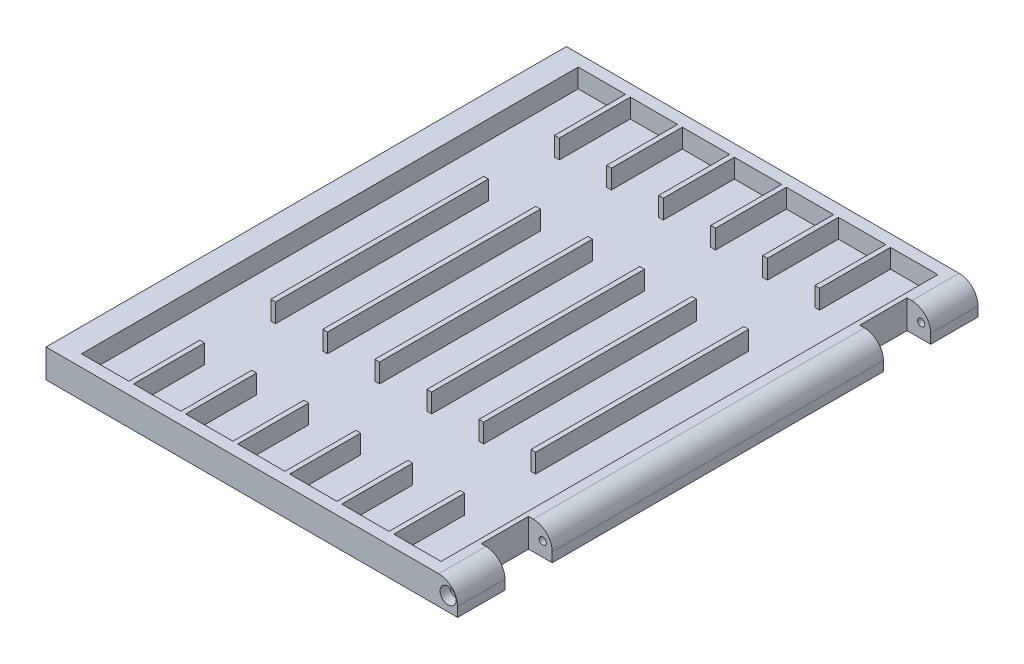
from build123d import *

# Parameters (mm, degrees)
EXTRUDE_3_DEPTH      = 4
EXTRUDE_3_DEPTH_BACK = 6
SKETCH_1_W           = 81.000407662
SKETCH_1_H           = 110
SKETCH_1_W_2         = 10
SKETCH_1_H_2         = 104.996759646
SKETCH_1_W_3         = 9.999997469
EXTRUDE_START        = -6
SKETCH_5_W           = 81.000407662
SKETCH_5_H           = 110
EXTRUDE_4_DEPTH      = 2
SKETCH_6_W           = 56.002129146
SKETCH_6_H           = 14.999755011
SKETCH_6_H_2         = 15.001340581
CUT_EXTRUDE_3_DEPTH  = 4
SKETCH_7_W           = 81.000407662
SKETCH_7_H           = 110
CUT_EXTRUDE_4_DEPTH  = 4
SKETCH_8_W           = 110
SKETCH_8_H           = 6
EXTRUDE_5_DEPTH      = 3.5
SKETCH_9_W           = 10
SKETCH_9_H           = 6
CUT_EXTRUDE_5_DEPTH  = 5
SKETCH_10_R          = 0.75
CUT_EXTRUDE_6_DEPTH  = 115
SKETCH_11_R          = 1.7
CUT_EXTRUDE_7_DEPTH  = 2
CUT_EXTRUDE_START    = -2
SKETCH_12_R          = 1.7
CUT_EXTRUDE_8_DEPTH  = 2
SKETCH_13_W          = 110
SKETCH_13_H          = 6
EXTRUDE_7_DEPTH      = 2.5
SKETCH_15_W          = 30
SKETCH_15_H          = 3.001159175
CUT_EXTRUDE_10_DEPTH = 2.5
FILLET_1_R           = 4


with BuildPart() as part:
    # Sketch 1 → Extrude 3 (new, two sides: drawn at the far end of the back side and taken through both)
    with BuildSketch(Plane(origin=(0, 0, 0), x_dir=(1, 0, 0), z_dir=(0, 1, 0)).offset(-EXTRUDE_3_DEPTH_BACK)):
        with Locations((40.500203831, 55)):
            Rectangle(SKETCH_1_W, SKETCH_1_H)
        with Locations((7.501958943, 55.000334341)):
            Rectangle(SKETCH_1_W_2, SKETCH_1_H_2, mode=Mode.SUBTRACT)
        with Locations((18.500765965, 55.000334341)):
            Rectangle(SKETCH_1_W_2, SKETCH_1_H_2, mode=Mode.SUBTRACT)
        with Locations((29.504005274, 55.000334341)):
            Rectangle(SKETCH_1_W_2, SKETCH_1_H_2, mode=Mode.SUBTRACT)
        with Locations((40.50242163, 55.000334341)):
            Rectangle(SKETCH_1_W_2, SKETCH_1_H_2, mode=Mode.SUBTRACT)
        with Locations((51.502043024, 55.000334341)):
            Rectangle(SKETCH_1_W_3, SKETCH_1_H_2, mode=Mode.SUBTRACT)
        with Locations((62.50084878, 55.000334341)):
            Rectangle(SKETCH_1_W_2, SKETCH_1_H_2, mode=Mode.SUBTRACT)
        with Locations((73.504088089, 55.000334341)):
            Rectangle(SKETCH_1_W_2, SKETCH_1_H_2, mode=Mode.SUBTRACT)
    extrude(amount=EXTRUDE_3_DEPTH + EXTRUDE_3_DEPTH_BACK)

    # Sketch 5 → Extrude 4 (add)
    with BuildSketch(Plane(origin=(0, 4, 0), x_dir=(1, 0, 0), z_dir=(0, 1, 0)).offset(EXTRUDE_START)):
        with Locations((40.500203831, 55)):
            Rectangle(SKETCH_5_W, SKETCH_5_H)
    extrude(amount=EXTRUDE_4_DEPTH)

    # Sketch 6 → Cut-Extrude 3 (cut)
    with BuildSketch(Plane(origin=(0, 4, 0), x_dir=(1, 0, 0), z_dir=(0, 1, 0))):
        with Locations((40.503023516, 25.004973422)):
            Rectangle(SKETCH_6_W, SKETCH_6_H)
        with Locations((40.503023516, 84.997777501)):
            Rectangle(SKETCH_6_W, SKETCH_6_H_2)
    extrude(amount=-CUT_EXTRUDE_3_DEPTH, mode=Mode.SUBTRACT)

    # Sketch 7 → Cut-Extrude 4 (cut)
    with BuildSketch(Plane.XZ.offset(6)):
        with Locations((40.500203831, -55)):
            Rectangle(SKETCH_7_W, SKETCH_7_H)
    extrude(amount=-CUT_EXTRUDE_4_DEPTH, mode=Mode.SUBTRACT)

    # Sketch 8 → Extrude 5 (add)
    with BuildSketch(Plane(origin=(81.000407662, 0, 0), x_dir=(0, 0, -1), z_dir=(1, 0, 0))):
        with Locations((55, 1)):
            Rectangle(SKETCH_8_W, SKETCH_8_H)
    extrude(amount=EXTRUDE_5_DEPTH)

    # Sketch 9 → Cut-Extrude 5 (cut)
    with BuildSketch(Plane(origin=(84.500407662, 0, 0), x_dir=(0, 0, -1), z_dir=(1, 0, 0))):
        with Locations((15, 1)):
            Rectangle(SKETCH_9_W, SKETCH_9_H)
        with Locations((95, 1)):
            Rectangle(SKETCH_9_W, SKETCH_9_H)
    extrude(amount=-CUT_EXTRUDE_5_DEPTH, mode=Mode.SUBTRACT)

    # Sketch 10 → Cut-Extrude 6 (cut)
    with BuildSketch(Plane(origin=(0, 0, -110), x_dir=(-1, 0, 0), z_dir=(0, 0, -1))):
        with Locations((-82.497978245, 1)):
            Circle(SKETCH_10_R)
    extrude(amount=-CUT_EXTRUDE_6_DEPTH, mode=Mode.SUBTRACT)

    # Sketch 11 → Cut-Extrude 7 (cut)
    with BuildSketch(Plane(origin=(0, 0, -110), x_dir=(-1, 0, 0), z_dir=(0, 0, -1))):
        with Locations((-82.497978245, 1)):
            Circle(SKETCH_11_R)
    extrude(amount=-CUT_EXTRUDE_7_DEPTH, mode=Mode.SUBTRACT)

    # Sketch 12 → Cut-Extrude 8 (cut)
    with BuildSketch(Plane.XY.offset(CUT_EXTRUDE_START)):
        with Locations(Location((82.497978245, 1, 0), (0, 0, 180))):
            Circle(SKETCH_12_R)
    extrude(amount=CUT_EXTRUDE_8_DEPTH, mode=Mode.SUBTRACT)

    # Sketch 13 → Extrude 7 (add)
    with BuildSketch(Plane.ZY):
        with Locations((-55, 1)):
            Rectangle(SKETCH_13_W, SKETCH_13_H)
    extrude(amount=EXTRUDE_7_DEPTH)

    # Sketch 15 → Cut-Extrude 10 (cut)
    with BuildSketch(Plane.ZY.offset(2.5)):
        with Locations((-54.995895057, -0.499420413)):
            Rectangle(SKETCH_15_W, SKETCH_15_H)
    extrude(amount=-CUT_EXTRUDE_10_DEPTH, mode=Mode.SUBTRACT)

    # Fillet 1
    fillet_1_edges = [part.edges().sort_by_distance(p)[0] for p in [
        (84.500407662, 4, -105),
        (84.500407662, 4, -55),
        (84.500407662, 4, -5),
    ]]
    fillet(fillet_1_edges, radius=FILLET_1_R)


solid = part.part
